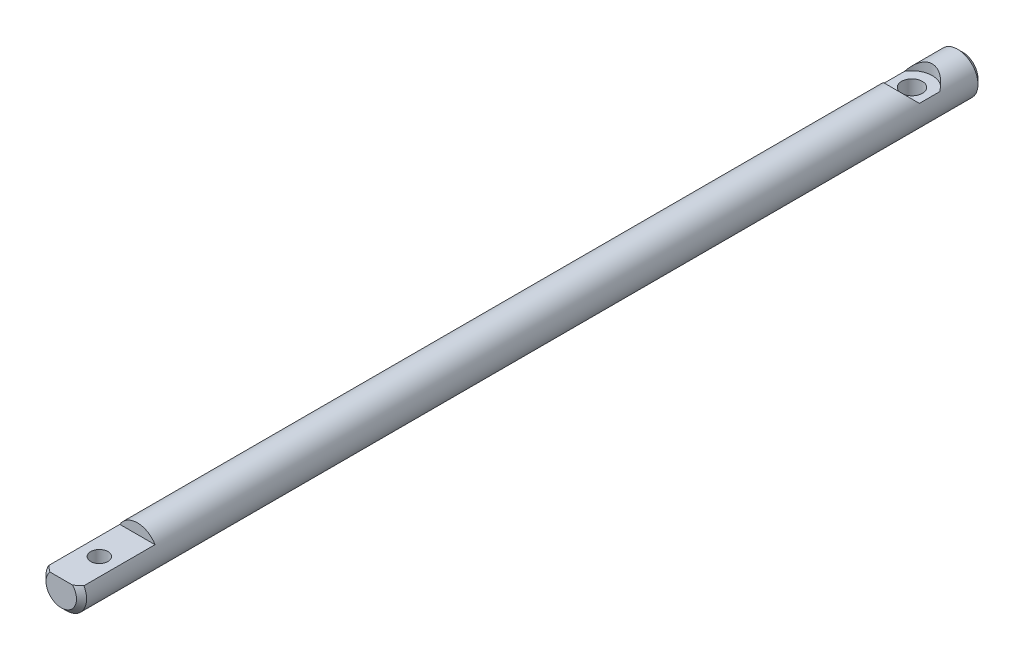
from build123d import *

# Parameters (mm, degrees)
ESQUISSE1_R                  = 8
BASE_EXTRUSION_DEPTH         = 355
ENL_V_MAT_EXTRU_1_DEPTH      = 345
ENL_V_MAT_EXTRU_1_DEPTH_BACK = 356.180235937
ESQUISSE2_R                  = 4.1
ESQUISSE4_R                  = 8
ENL_V_MAT_EXTRU_3_DEPTH      = 356.292837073
CHANFREIN1_SIZE              = 2
ENL_V_MAT_EXTRU_4_DEPTH      = 356.180235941
ENL_V_MAT_EXTRU_4_DEPTH_BACK = 356.180235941
ESQUISSE5_W                  = 30
ESQUISSE5_H                  = 4
TROU_TARAUD_M8X1_251_D       = 6.8


with BuildPart() as part:
    # Esquisse1 → Base-Extrusion (new body)
    with BuildSketch(Plane.XY):
        Circle(ESQUISSE1_R)
    extrude(amount=BASE_EXTRUSION_DEPTH)

    # Esquisse2 → Enl_v. mat.-Extru.1 (cut, two sides: drawn at the far end of the back side and taken through both)
    with BuildSketch(Plane(origin=(0, 0, 0), x_dir=(1, 0, 0), z_dir=(0, 1, 0)).offset(-ENL_V_MAT_EXTRU_1_DEPTH_BACK)):
        with Locations(Location((0, -20, 0), (0, 0, 270))):
            Circle(ESQUISSE2_R)
    extrude(amount=ENL_V_MAT_EXTRU_1_DEPTH + ENL_V_MAT_EXTRU_1_DEPTH_BACK, mode=Mode.SUBTRACT)

    # Esquisse4 → Enl_v. mat.-Extru.3 (cut, through all)
    with BuildSketch(Plane(origin=(0, 4, 0), x_dir=(-1, 0, 0), z_dir=(0, 1, 0))):
        with Locations((0, 20)):
            Circle(ESQUISSE4_R)
    extrude(amount=ENL_V_MAT_EXTRU_3_DEPTH, mode=Mode.SUBTRACT)

    # Chanfrein1
    chanfrein1_edges = [part.edges().sort_by_distance(p)[0] for p in [
        (-8, 0, 0),
        (-8, 0, 355),
    ]]
    chamfer(chanfrein1_edges, length=CHANFREIN1_SIZE)

    # Esquisse5 → Enl_v. mat.-Extru.4 (cut, two sides: drawn at the far end of the back side and taken through both)
    with BuildSketch(Plane(origin=(0, 0, 0), x_dir=(0, 0, -1), z_dir=(1, 0, 0)).offset(-ENL_V_MAT_EXTRU_4_DEPTH_BACK)):
        with Locations((-340, 6)):
            Rectangle(ESQUISSE5_W, ESQUISSE5_H)
    extrude(amount=ENL_V_MAT_EXTRU_4_DEPTH + ENL_V_MAT_EXTRU_4_DEPTH_BACK, mode=Mode.SUBTRACT)

    # Trou taraud_ M8x1.251 (through all)
    with Locations(Plane(origin=(0, 4, 0), x_dir=(-1, 0, 0), z_dir=(0, 1, 0))):
        with Locations((0, 340)):
            Hole(TROU_TARAUD_M8X1_251_D / 2)


solid = part.part
